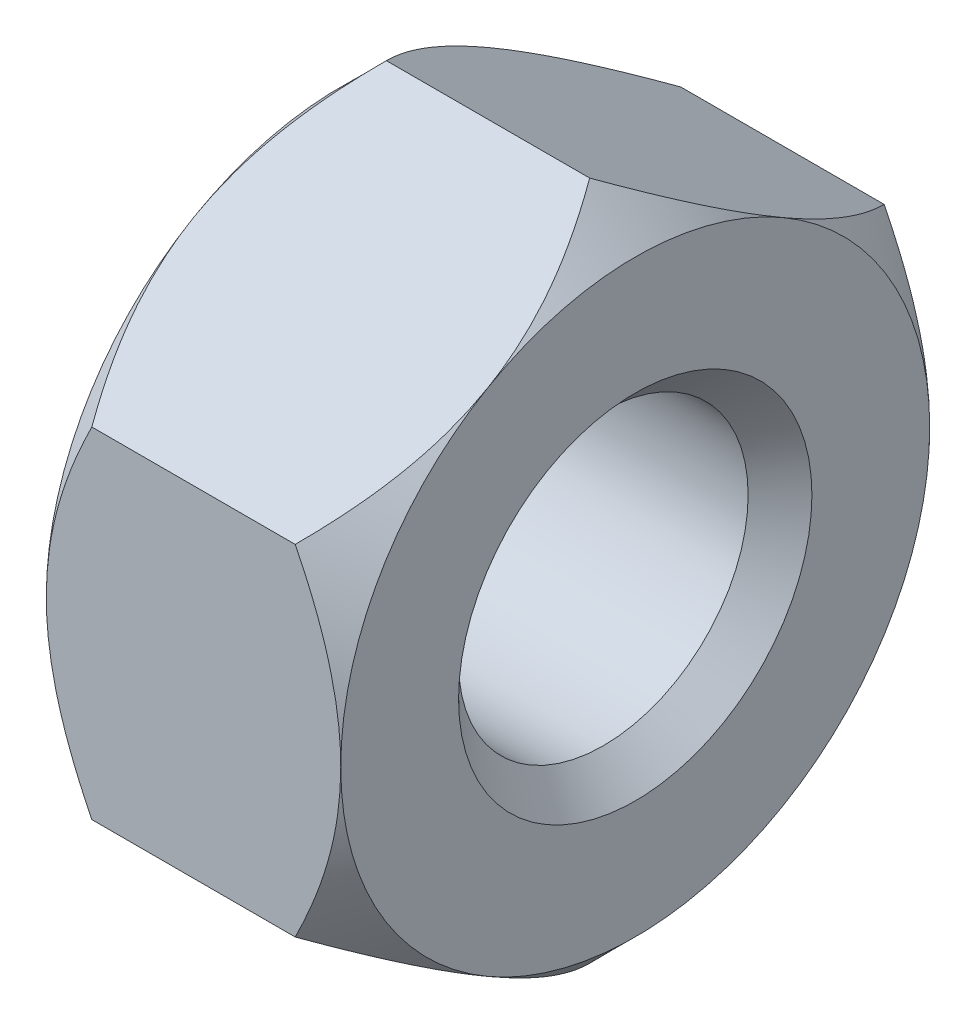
ISO-10303-21;
HEADER;
FILE_DESCRIPTION(('STEP AP214'),'2;1');
FILE_NAME('part.step','',(''),(''),'','','');
FILE_SCHEMA(('AUTOMOTIVE_DESIGN { 1 0 10303 214 1 1 1 1 }'));
ENDSEC;
DATA;
#1=APPLICATION_CONTEXT('core data for automotive mechanical design processes');
#2=APPLICATION_PROTOCOL_DEFINITION('international standard','automotive_design',2000,#1);
#3=PRODUCT_CONTEXT('',#1,'mechanical');
#4=PRODUCT('Part','Part','',(#3));
#5=PRODUCT_RELATED_PRODUCT_CATEGORY('part','',(#4));
#6=PRODUCT_DEFINITION_FORMATION('','',#4);
#7=PRODUCT_DEFINITION_CONTEXT('part definition',#1,'design');
#8=PRODUCT_DEFINITION('design','',#6,#7);
#9=PRODUCT_DEFINITION_SHAPE('','',#8);
#10=(LENGTH_UNIT() NAMED_UNIT(*) SI_UNIT(.MILLI.,.METRE.));
#11=(NAMED_UNIT(*) PLANE_ANGLE_UNIT() SI_UNIT($,.RADIAN.));
#12=(NAMED_UNIT(*) SI_UNIT($,.STERADIAN.) SOLID_ANGLE_UNIT());
#13=UNCERTAINTY_MEASURE_WITH_UNIT(LENGTH_MEASURE(1.E-05),#10,'distance_accuracy_value','');
#14=(GEOMETRIC_REPRESENTATION_CONTEXT(3) GLOBAL_UNCERTAINTY_ASSIGNED_CONTEXT((#13)) GLOBAL_UNIT_ASSIGNED_CONTEXT((#10,
#11,#12)) REPRESENTATION_CONTEXT('',''));
#15=CARTESIAN_POINT('',(0.,0.,0.));
#16=DIRECTION('',(0.,0.,1.));
#17=DIRECTION('',(1.,0.,0.));
#18=AXIS2_PLACEMENT_3D('',#15,#16,#17);
#19=CARTESIAN_POINT('',(5.,5.,0.));
#20=DIRECTION('',(-1.,0.,0.));
#21=DIRECTION('',(0.,0.,1.));
#22=AXIS2_PLACEMENT_3D('',#19,#20,#21);
#23=PLANE('',#22);
#24=CARTESIAN_POINT('',(4.99999999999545,0.,0.));
#25=DIRECTION('',(1.,0.,0.));
#26=DIRECTION('',(0.,0.,-1.));
#27=AXIS2_PLACEMENT_3D('',#24,#25,#26);
#28=CIRCLE('',#27,3.00000000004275);
#29=CARTESIAN_POINT('',(4.99999999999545,0.,-3.00000000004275));
#30=VERTEX_POINT('',#29);
#31=EDGE_CURVE('E273',#30,#30,#28,.F.);
#32=ORIENTED_EDGE('',*,*,#31,.T.);
#33=EDGE_LOOP('',(#32));
#34=FACE_BOUND('',#33,.T.);
#35=CARTESIAN_POINT('',(4.99999999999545,0.,0.));
#36=DIRECTION('',(-1.,0.,0.));
#37=DIRECTION('',(0.,0.,1.));
#38=AXIS2_PLACEMENT_3D('',#35,#36,#37);
#39=CIRCLE('',#38,4.99999999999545);
#40=CARTESIAN_POINT('',(4.99999999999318,-4.3301270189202,2.4999999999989));
#41=VERTEX_POINT('',#40);
#42=CARTESIAN_POINT('',(4.99999999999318,0.,4.99999999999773));
#43=VERTEX_POINT('',#42);
#44=EDGE_CURVE('E117',#41,#43,#39,.T.);
#45=ORIENTED_EDGE('',*,*,#44,.F.);
#46=CARTESIAN_POINT('',(4.99999999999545,0.,0.));
#47=DIRECTION('',(-1.,0.,0.));
#48=DIRECTION('',(0.,0.,1.));
#49=AXIS2_PLACEMENT_3D('',#46,#47,#48);
#50=CIRCLE('',#49,4.99999999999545);
#51=CARTESIAN_POINT('',(4.99999999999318,-4.33012701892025,-2.49999999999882));
#52=VERTEX_POINT('',#51);
#53=EDGE_CURVE('E20',#52,#41,#50,.T.);
#54=ORIENTED_EDGE('',*,*,#53,.F.);
#55=CARTESIAN_POINT('',(4.99999999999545,0.,0.));
#56=DIRECTION('',(-1.,0.,0.));
#57=DIRECTION('',(0.,0.,1.));
#58=AXIS2_PLACEMENT_3D('',#55,#56,#57);
#59=CIRCLE('',#58,4.99999999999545);
#60=CARTESIAN_POINT('',(4.99999999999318,0.,-4.99999999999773));
#61=VERTEX_POINT('',#60);
#62=EDGE_CURVE('E103',#61,#52,#59,.T.);
#63=ORIENTED_EDGE('',*,*,#62,.F.);
#64=CARTESIAN_POINT('',(4.99999999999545,0.,0.));
#65=DIRECTION('',(-1.,0.,0.));
#66=DIRECTION('',(0.,0.,1.));
#67=AXIS2_PLACEMENT_3D('',#64,#65,#66);
#68=CIRCLE('',#67,4.99999999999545);
#69=CARTESIAN_POINT('',(4.99999999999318,4.3301270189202,-2.4999999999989));
#70=VERTEX_POINT('',#69);
#71=EDGE_CURVE('E113',#70,#61,#68,.T.);
#72=ORIENTED_EDGE('',*,*,#71,.F.);
#73=CARTESIAN_POINT('',(4.99999999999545,0.,0.));
#74=DIRECTION('',(-1.,0.,0.));
#75=DIRECTION('',(0.,0.,1.));
#76=AXIS2_PLACEMENT_3D('',#73,#74,#75);
#77=CIRCLE('',#76,4.99999999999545);
#78=CARTESIAN_POINT('',(4.99999999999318,4.33012701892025,2.49999999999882));
#79=VERTEX_POINT('',#78);
#80=EDGE_CURVE('E414',#79,#70,#77,.T.);
#81=ORIENTED_EDGE('',*,*,#80,.F.);
#82=CARTESIAN_POINT('',(4.99999999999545,0.,0.));
#83=DIRECTION('',(-1.,0.,0.));
#84=DIRECTION('',(0.,0.,1.));
#85=AXIS2_PLACEMENT_3D('',#82,#83,#84);
#86=CIRCLE('',#85,4.99999999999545);
#87=EDGE_CURVE('E436',#43,#79,#86,.T.);
#88=ORIENTED_EDGE('',*,*,#87,.F.);
#89=EDGE_LOOP('',(#45,#54,#63,#72,#81,#88));
#90=FACE_BOUND('',#89,.T.);
#91=ADVANCED_FACE('F17',(#34,#90),#23,.F.);
#92=CARTESIAN_POINT('',(4.22185629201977,0.,0.));
#93=DIRECTION('',(-1.,0.,0.));
#94=DIRECTION('',(0.,0.,1.));
#95=AXIS2_PLACEMENT_3D('',#92,#93,#94);
#96=CONICAL_SURFACE('',#95,5.7781437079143,0.785398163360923);
#97=CARTESIAN_POINT('',(4.99999999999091,-4.33012701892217,2.50000000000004));
#98=CARTESIAN_POINT('',(5.00000614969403,-4.36852433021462,2.43349390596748));
#99=CARTESIAN_POINT('',(4.99822988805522,-4.40691590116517,2.36699775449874));
#100=CARTESIAN_POINT('',(4.99117047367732,-4.48361249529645,2.23415535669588));
#101=CARTESIAN_POINT('',(4.98588787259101,-4.52191753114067,2.16780908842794));
#102=CARTESIAN_POINT('',(4.96489427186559,-4.63645730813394,1.96942037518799));
#103=CARTESIAN_POINT('',(4.94403701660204,-4.7124689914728,1.83776427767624));
#104=CARTESIAN_POINT('',(4.89011214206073,-4.86218746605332,1.57844427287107));
#105=CARTESIAN_POINT('',(4.85723342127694,-4.93591172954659,1.45075010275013));
#106=CARTESIAN_POINT('',(4.78069544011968,-5.0819613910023,1.19778466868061));
#107=CARTESIAN_POINT('',(4.73703280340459,-5.15428634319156,1.07251417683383));
#108=CARTESIAN_POINT('',(4.65724434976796,-5.27256953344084,0.867641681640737));
#109=CARTESIAN_POINT('',(4.62374942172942,-5.31898017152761,0.787256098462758));
#110=CARTESIAN_POINT('',(4.55326206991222,-5.41112170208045,0.62766228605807));
#111=CARTESIAN_POINT('',(4.5162703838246,-5.45685273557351,0.548453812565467));
#112=CARTESIAN_POINT('',(4.43878280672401,-5.54812148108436,0.390371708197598));
#113=CARTESIAN_POINT('',(4.39825463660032,-5.59365230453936,0.311510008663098));
#114=CARTESIAN_POINT('',(4.31439142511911,-5.68406037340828,0.154918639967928));
#115=CARTESIAN_POINT('',(4.27105657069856,-5.72893766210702,0.0771888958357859));
#116=CARTESIAN_POINT('',(4.22649730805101,-5.77350269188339,2.22876933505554E-11));
#117=B_SPLINE_CURVE_WITH_KNOTS('',3,(#97,#98,#99,#100,#101,#102,#103,#104,#105,#106,#107,#108,
#109,#110,#111,#112,#113,#114,#115,#116),.UNSPECIFIED.,.F.,.F.,(4,2,2,2,2,2,2,2,2,4),(0.,
0.230341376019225,0.460646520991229,0.920346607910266,1.37311358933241,1.82602250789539,
2.12199524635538,2.41790568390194,2.71687590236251,3.0158262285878),.UNSPECIFIED.);
#118=CARTESIAN_POINT('',(4.22649730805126,-5.77350269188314,0.));
#119=VERTEX_POINT('',#118);
#120=EDGE_CURVE('E131',#41,#119,#117,.T.);
#121=ORIENTED_EDGE('',*,*,#120,.T.);
#122=CARTESIAN_POINT('',(4.22649730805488,-5.77350269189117,-2.52782082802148E-11));
#123=CARTESIAN_POINT('',(4.27644123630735,-5.72355106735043,-0.0865187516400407));
#124=CARTESIAN_POINT('',(4.32484266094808,-5.6732131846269,-0.173706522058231));
#125=CARTESIAN_POINT('',(4.41808914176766,-5.5716870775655,-0.349554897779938));
#126=CARTESIAN_POINT('',(4.46293213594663,-5.52049838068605,-0.438216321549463));
#127=CARTESIAN_POINT('',(4.59183821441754,-5.36501502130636,-0.707521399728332));
#128=CARTESIAN_POINT('',(4.66967475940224,-5.25939347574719,-0.890463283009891));
#129=CARTESIAN_POINT('',(4.8018131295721,-5.04779804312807,-1.25695732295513));
#130=CARTESIAN_POINT('',(4.85673320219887,-4.9419236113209,-1.44033721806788));
#131=CARTESIAN_POINT('',(4.92027051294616,-4.7814199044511,-1.71833779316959));
#132=CARTESIAN_POINT('',(4.93829854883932,-4.72770350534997,-1.81137732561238));
#133=CARTESIAN_POINT('',(4.96767507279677,-4.61982204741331,-1.99823349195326));
#134=CARTESIAN_POINT('',(4.97902569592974,-4.56565713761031,-2.09204986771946));
#135=CARTESIAN_POINT('',(4.9912304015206,-4.48127537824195,-2.23820336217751));
#136=CARTESIAN_POINT('',(4.99450796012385,-4.45114159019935,-2.2903966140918));
#137=CARTESIAN_POINT('',(4.99889831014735,-4.39071515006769,-2.39505827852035));
#138=CARTESIAN_POINT('',(5.00000247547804,-4.3604223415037,-2.44752696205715));
#139=CARTESIAN_POINT('',(4.99999999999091,-4.33012701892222,-2.49999999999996));
#140=B_SPLINE_CURVE_WITH_KNOTS('',3,(#122,#123,#124,#125,#126,#127,#128,#129,#130,#131,#132,
#133,#134,#135,#136,#137,#138,#139),.UNSPECIFIED.,.F.,.F.,(4,2,2,2,2,2,2,2,4),(0.,
0.335055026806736,0.670302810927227,1.34476662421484,1.99962838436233,2.32625984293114,
2.6527868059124,2.83382184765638,3.0155739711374),.UNSPECIFIED.);
#141=EDGE_CURVE('E125',#119,#52,#140,.T.);
#142=ORIENTED_EDGE('',*,*,#141,.T.);
#143=ORIENTED_EDGE('',*,*,#53,.T.);
#144=EDGE_LOOP('',(#121,#142,#143));
#145=FACE_BOUND('',#144,.T.);
#146=ADVANCED_FACE('F130',(#145),#96,.T.);
#147=CARTESIAN_POINT('',(4.22185629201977,0.,0.));
#148=DIRECTION('',(-1.,0.,0.));
#149=DIRECTION('',(0.,0.,1.));
#150=AXIS2_PLACEMENT_3D('',#147,#148,#149);
#151=CONICAL_SURFACE('',#150,5.7781437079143,0.785398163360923);
#152=CARTESIAN_POINT('',(4.99999999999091,-4.33012701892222,-2.49999999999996));
#153=CARTESIAN_POINT('',(5.00000614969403,-4.29172970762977,-2.56650609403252));
#154=CARTESIAN_POINT('',(4.99822988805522,-4.25333813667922,-2.63300224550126));
#155=CARTESIAN_POINT('',(4.99117047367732,-4.17664154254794,-2.76584464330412));
#156=CARTESIAN_POINT('',(4.98588787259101,-4.13833650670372,-2.83219091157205));
#157=CARTESIAN_POINT('',(4.96489427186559,-4.02379672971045,-3.03057962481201));
#158=CARTESIAN_POINT('',(4.94403701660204,-3.94778504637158,-3.16223572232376));
#159=CARTESIAN_POINT('',(4.89011214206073,-3.79806657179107,-3.42155572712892));
#160=CARTESIAN_POINT('',(4.85723342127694,-3.7243423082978,-3.54924989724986));
#161=CARTESIAN_POINT('',(4.78069544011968,-3.57829264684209,-3.80221533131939));
#162=CARTESIAN_POINT('',(4.73703280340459,-3.50596769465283,-3.92748582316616));
#163=CARTESIAN_POINT('',(4.65724434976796,-3.38768450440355,-4.13235831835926));
#164=CARTESIAN_POINT('',(4.62374942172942,-3.34127386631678,-4.21274390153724));
#165=CARTESIAN_POINT('',(4.55326206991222,-3.24913233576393,-4.37233771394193));
#166=CARTESIAN_POINT('',(4.5162703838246,-3.20340130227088,-4.45154618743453));
#167=CARTESIAN_POINT('',(4.43878280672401,-3.11213255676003,-4.6096282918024));
#168=CARTESIAN_POINT('',(4.39825463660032,-3.06660173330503,-4.6884899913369));
#169=CARTESIAN_POINT('',(4.31439142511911,-2.9761936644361,-4.84508136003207));
#170=CARTESIAN_POINT('',(4.27105657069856,-2.93131637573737,-4.92281110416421));
#171=CARTESIAN_POINT('',(4.22649730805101,-2.886751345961,-4.99999999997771));
#172=B_SPLINE_CURVE_WITH_KNOTS('',3,(#152,#153,#154,#155,#156,#157,#158,#159,#160,#161,#162,
#163,#164,#165,#166,#167,#168,#169,#170,#171),.UNSPECIFIED.,.F.,.F.,(4,2,2,2,2,2,2,2,2,4),(0.,
0.230341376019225,0.460646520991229,0.920346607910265,1.3731135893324,1.82602250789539,
2.12199524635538,2.41790568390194,2.71687590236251,3.01582622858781),.UNSPECIFIED.);
#173=CARTESIAN_POINT('',(4.22649730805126,-2.88675134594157,-4.99999999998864));
#174=VERTEX_POINT('',#173);
#175=EDGE_CURVE('E107',#52,#174,#172,.T.);
#176=ORIENTED_EDGE('',*,*,#175,.T.);
#177=CARTESIAN_POINT('',(4.22649730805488,-2.88675134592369,-5.00000000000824));
#178=CARTESIAN_POINT('',(4.27644123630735,-2.78684809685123,-5.00000000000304));
#179=CARTESIAN_POINT('',(4.32484266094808,-2.68617233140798,-5.00000000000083));
#180=CARTESIAN_POINT('',(4.41808914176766,-2.48312011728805,-4.99999999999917));
#181=CARTESIAN_POINT('',(4.46293213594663,-2.38074272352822,-4.99999999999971));
#182=CARTESIAN_POINT('',(4.59183821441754,-2.06977600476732,-5.00000000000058));
#183=CARTESIAN_POINT('',(4.66967475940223,-1.85853291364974,-5.00000000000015));
#184=CARTESIAN_POINT('',(4.8018131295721,-1.43534204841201,-4.99999999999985));
#185=CARTESIAN_POINT('',(4.85673320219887,-1.22359318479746,-4.99999999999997));
#186=CARTESIAN_POINT('',(4.92027051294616,-0.9025857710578,-5.00000000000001));
#187=CARTESIAN_POINT('',(4.93829854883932,-0.795152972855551,-5.));
#188=CARTESIAN_POINT('',(4.96767507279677,-0.579390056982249,-5.));
#189=CARTESIAN_POINT('',(4.97902569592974,-0.471060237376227,-5.));
#190=CARTESIAN_POINT('',(4.9912304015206,-0.302296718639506,-5.));
#191=CARTESIAN_POINT('',(4.99450796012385,-0.242029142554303,-5.));
#192=CARTESIAN_POINT('',(4.99889831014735,-0.121176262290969,-5.));
#193=CARTESIAN_POINT('',(5.00000247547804,-0.0605906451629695,-5.));
#194=CARTESIAN_POINT('',(4.99999999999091,0.,-5.));
#195=B_SPLINE_CURVE_WITH_KNOTS('',3,(#177,#178,#179,#180,#181,#182,#183,#184,#185,#186,#187,
#188,#189,#190,#191,#192,#193,#194),.UNSPECIFIED.,.F.,.F.,(4,2,2,2,2,2,2,2,4),(0.,
0.335055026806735,0.670302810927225,1.34476662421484,1.99962838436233,2.32625984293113,
2.6527868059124,2.8338218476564,3.01557397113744),.UNSPECIFIED.);
#196=EDGE_CURVE('E109',#174,#61,#195,.T.);
#197=ORIENTED_EDGE('',*,*,#196,.T.);
#198=ORIENTED_EDGE('',*,*,#62,.T.);
#199=EDGE_LOOP('',(#176,#197,#198));
#200=FACE_BOUND('',#199,.T.);
#201=ADVANCED_FACE('F105',(#200),#151,.T.);
#202=CARTESIAN_POINT('',(4.22185629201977,0.,0.));
#203=DIRECTION('',(-1.,0.,0.));
#204=DIRECTION('',(0.,0.,1.));
#205=AXIS2_PLACEMENT_3D('',#202,#203,#204);
#206=CONICAL_SURFACE('',#205,5.7781437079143,0.785398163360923);
#207=CARTESIAN_POINT('',(4.99999999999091,0.,-5.));
#208=CARTESIAN_POINT('',(5.00000614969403,0.0767946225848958,-5.));
#209=CARTESIAN_POINT('',(4.99822988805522,0.153577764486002,-5.));
#210=CARTESIAN_POINT('',(4.99117047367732,0.306970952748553,-5.));
#211=CARTESIAN_POINT('',(4.98588787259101,0.383581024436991,-5.));
#212=CARTESIAN_POINT('',(4.96489427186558,0.612660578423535,-5.));
#213=CARTESIAN_POINT('',(4.94403701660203,0.764683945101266,-5.));
#214=CARTESIAN_POINT('',(4.89011214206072,1.0641208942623,-5.));
#215=CARTESIAN_POINT('',(4.85723342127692,1.21156942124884,-5.));
#216=CARTESIAN_POINT('',(4.78069544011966,1.50366874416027,-5.));
#217=CARTESIAN_POINT('',(4.73703280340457,1.64831864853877,-5.));
#218=CARTESIAN_POINT('',(4.65724434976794,1.88488502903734,-5.));
#219=CARTESIAN_POINT('',(4.6237494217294,1.97770630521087,-5.));
#220=CARTESIAN_POINT('',(4.55326206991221,2.16198936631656,-5.));
#221=CARTESIAN_POINT('',(4.51627038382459,2.25345143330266,-5.));
#222=CARTESIAN_POINT('',(4.438782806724,2.43598892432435,-5.));
#223=CARTESIAN_POINT('',(4.39825463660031,2.52705057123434,-5.));
#224=CARTESIAN_POINT('',(4.31439142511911,2.70786670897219,-5.));
#225=CARTESIAN_POINT('',(4.27105657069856,2.79762128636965,-5.));
#226=CARTESIAN_POINT('',(4.22649730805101,2.88675134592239,-5.));
#227=B_SPLINE_CURVE_WITH_KNOTS('',3,(#207,#208,#209,#210,#211,#212,#213,#214,#215,#216,#217,
#218,#219,#220,#221,#222,#223,#224,#225,#226),.UNSPECIFIED.,.F.,.F.,(4,2,2,2,2,2,2,2,2,4),(0.,
0.230341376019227,0.460646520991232,0.920346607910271,1.37311358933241,1.8260225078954,
2.12199524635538,2.41790568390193,2.71687590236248,3.01582622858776),.UNSPECIFIED.);
#228=CARTESIAN_POINT('',(4.22649730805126,2.88675134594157,-4.99999999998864));
#229=VERTEX_POINT('',#228);
#230=EDGE_CURVE('E166',#61,#229,#227,.T.);
#231=ORIENTED_EDGE('',*,*,#230,.T.);
#232=CARTESIAN_POINT('',(4.22649730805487,2.88675134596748,-4.99999999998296));
#233=CARTESIAN_POINT('',(4.27644123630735,2.93670297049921,-4.913481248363));
#234=CARTESIAN_POINT('',(4.32484266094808,2.98704085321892,-4.8262934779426));
#235=CARTESIAN_POINT('',(4.41808914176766,3.08856696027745,-4.65044510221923));
#236=CARTESIAN_POINT('',(4.46293213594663,3.13975565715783,-4.56178367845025));
#237=CARTESIAN_POINT('',(4.59183821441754,3.29523901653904,-4.29247860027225));
#238=CARTESIAN_POINT('',(4.66967475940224,3.40086056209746,-4.10953671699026));
#239=CARTESIAN_POINT('',(4.8018131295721,3.61245599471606,-3.74304267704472));
#240=CARTESIAN_POINT('',(4.85673320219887,3.71833042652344,-3.55966278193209));
#241=CARTESIAN_POINT('',(4.92027051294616,3.87883413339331,-3.28166220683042));
#242=CARTESIAN_POINT('',(4.93829854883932,3.93255053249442,-3.18862267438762));
#243=CARTESIAN_POINT('',(4.96767507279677,4.04043199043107,-3.00176650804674));
#244=CARTESIAN_POINT('',(4.97902569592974,4.09459690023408,-2.90795013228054));
#245=CARTESIAN_POINT('',(4.9912304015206,4.17897865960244,-2.76179663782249));
#246=CARTESIAN_POINT('',(4.99450796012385,4.20911244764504,-2.7096033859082));
#247=CARTESIAN_POINT('',(4.99889831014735,4.26953888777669,-2.60494172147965));
#248=CARTESIAN_POINT('',(5.00000247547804,4.29983169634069,-2.55247303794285));
#249=CARTESIAN_POINT('',(4.99999999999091,4.33012701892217,-2.50000000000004));
#250=B_SPLINE_CURVE_WITH_KNOTS('',3,(#232,#233,#234,#235,#236,#237,#238,#239,#240,#241,#242,
#243,#244,#245,#246,#247,#248,#249),.UNSPECIFIED.,.F.,.F.,(4,2,2,2,2,2,2,2,4),(0.,
0.335055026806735,0.670302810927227,1.34476662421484,1.99962838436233,2.32625984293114,
2.6527868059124,2.83382184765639,3.0155739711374),.UNSPECIFIED.);
#251=EDGE_CURVE('E378',#229,#70,#250,.T.);
#252=ORIENTED_EDGE('',*,*,#251,.T.);
#253=ORIENTED_EDGE('',*,*,#71,.T.);
#254=EDGE_LOOP('',(#231,#252,#253));
#255=FACE_BOUND('',#254,.T.);
#256=ADVANCED_FACE('F158',(#255),#206,.T.);
#257=CARTESIAN_POINT('',(4.22185629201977,0.,0.));
#258=DIRECTION('',(-1.,0.,0.));
#259=DIRECTION('',(0.,0.,1.));
#260=AXIS2_PLACEMENT_3D('',#257,#258,#259);
#261=CONICAL_SURFACE('',#260,5.7781437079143,0.785398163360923);
#262=CARTESIAN_POINT('',(4.99999999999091,0.,5.));
#263=CARTESIAN_POINT('',(5.00000614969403,-0.0767946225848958,5.));
#264=CARTESIAN_POINT('',(4.99822988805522,-0.153577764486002,5.));
#265=CARTESIAN_POINT('',(4.99117047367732,-0.306970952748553,5.));
#266=CARTESIAN_POINT('',(4.98588787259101,-0.383581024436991,5.));
#267=CARTESIAN_POINT('',(4.96489427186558,-0.612660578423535,5.));
#268=CARTESIAN_POINT('',(4.94403701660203,-0.764683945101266,5.));
#269=CARTESIAN_POINT('',(4.89011214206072,-1.0641208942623,5.));
#270=CARTESIAN_POINT('',(4.85723342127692,-1.21156942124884,5.));
#271=CARTESIAN_POINT('',(4.78069544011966,-1.50366874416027,5.));
#272=CARTESIAN_POINT('',(4.73703280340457,-1.64831864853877,5.));
#273=CARTESIAN_POINT('',(4.65724434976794,-1.88488502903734,5.));
#274=CARTESIAN_POINT('',(4.6237494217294,-1.97770630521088,5.));
#275=CARTESIAN_POINT('',(4.55326206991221,-2.16198936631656,5.));
#276=CARTESIAN_POINT('',(4.51627038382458,-2.25345143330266,5.));
#277=CARTESIAN_POINT('',(4.438782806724,-2.43598892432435,5.));
#278=CARTESIAN_POINT('',(4.39825463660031,-2.52705057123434,5.));
#279=CARTESIAN_POINT('',(4.31439142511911,-2.70786670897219,5.));
#280=CARTESIAN_POINT('',(4.27105657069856,-2.79762128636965,5.));
#281=CARTESIAN_POINT('',(4.22649730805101,-2.88675134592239,5.));
#282=B_SPLINE_CURVE_WITH_KNOTS('',3,(#262,#263,#264,#265,#266,#267,#268,#269,#270,#271,#272,
#273,#274,#275,#276,#277,#278,#279,#280,#281),.UNSPECIFIED.,.F.,.F.,(4,2,2,2,2,2,2,2,2,4),(0.,
0.230341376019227,0.460646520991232,0.920346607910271,1.37311358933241,1.8260225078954,
2.12199524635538,2.41790568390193,2.71687590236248,3.01582622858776),.UNSPECIFIED.);
#283=CARTESIAN_POINT('',(4.2264973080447,-2.88675134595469,4.99999999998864));
#284=VERTEX_POINT('',#283);
#285=EDGE_CURVE('E284',#43,#284,#282,.T.);
#286=ORIENTED_EDGE('',*,*,#285,.T.);
#287=CARTESIAN_POINT('',(4.22649730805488,-2.88675134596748,4.99999999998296));
#288=CARTESIAN_POINT('',(4.27644123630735,-2.93670297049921,4.91348124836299));
#289=CARTESIAN_POINT('',(4.32484266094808,-2.98704085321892,4.8262934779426));
#290=CARTESIAN_POINT('',(4.41808914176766,-3.08856696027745,4.65044510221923));
#291=CARTESIAN_POINT('',(4.46293213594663,-3.13975565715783,4.56178367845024));
#292=CARTESIAN_POINT('',(4.59183821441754,-3.29523901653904,4.29247860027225));
#293=CARTESIAN_POINT('',(4.66967475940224,-3.40086056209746,4.10953671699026));
#294=CARTESIAN_POINT('',(4.8018131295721,-3.61245599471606,3.74304267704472));
#295=CARTESIAN_POINT('',(4.85673320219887,-3.71833042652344,3.55966278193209));
#296=CARTESIAN_POINT('',(4.92027051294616,-3.87883413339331,3.28166220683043));
#297=CARTESIAN_POINT('',(4.93829854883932,-3.93255053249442,3.18862267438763));
#298=CARTESIAN_POINT('',(4.96767507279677,-4.04043199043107,3.00176650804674));
#299=CARTESIAN_POINT('',(4.97902569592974,-4.09459690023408,2.90795013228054));
#300=CARTESIAN_POINT('',(4.9912304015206,-4.17897865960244,2.76179663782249));
#301=CARTESIAN_POINT('',(4.99450796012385,-4.20911244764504,2.7096033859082));
#302=CARTESIAN_POINT('',(4.99889831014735,-4.26953888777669,2.60494172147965));
#303=CARTESIAN_POINT('',(5.00000247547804,-4.29983169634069,2.55247303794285));
#304=CARTESIAN_POINT('',(4.99999999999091,-4.33012701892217,2.50000000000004));
#305=B_SPLINE_CURVE_WITH_KNOTS('',3,(#287,#288,#289,#290,#291,#292,#293,#294,#295,#296,#297,
#298,#299,#300,#301,#302,#303,#304),.UNSPECIFIED.,.F.,.F.,(4,2,2,2,2,2,2,2,4),(0.,
0.335055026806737,0.670302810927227,1.34476662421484,1.99962838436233,2.32625984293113,
2.6527868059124,2.83382184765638,3.0155739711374),.UNSPECIFIED.);
#306=EDGE_CURVE('E267',#284,#41,#305,.T.);
#307=ORIENTED_EDGE('',*,*,#306,.T.);
#308=ORIENTED_EDGE('',*,*,#44,.T.);
#309=EDGE_LOOP('',(#286,#307,#308));
#310=FACE_BOUND('',#309,.T.);
#311=ADVANCED_FACE('F275',(#310),#261,.T.);
#312=CARTESIAN_POINT('',(4.22185629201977,0.,0.));
#313=DIRECTION('',(-1.,0.,0.));
#314=DIRECTION('',(0.,0.,1.));
#315=AXIS2_PLACEMENT_3D('',#312,#313,#314);
#316=CONICAL_SURFACE('',#315,5.7781437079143,0.785398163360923);
#317=CARTESIAN_POINT('',(4.22649730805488,5.77350269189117,2.52780452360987E-11));
#318=CARTESIAN_POINT('',(4.27644123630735,5.72355106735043,0.0865187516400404));
#319=CARTESIAN_POINT('',(4.32484266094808,5.6732131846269,0.173706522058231));
#320=CARTESIAN_POINT('',(4.41808914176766,5.5716870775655,0.349554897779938));
#321=CARTESIAN_POINT('',(4.46293213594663,5.52049838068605,0.438216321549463));
#322=CARTESIAN_POINT('',(4.59183821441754,5.36501502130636,0.707521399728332));
#323=CARTESIAN_POINT('',(4.66967475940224,5.25939347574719,0.890463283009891));
#324=CARTESIAN_POINT('',(4.8018131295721,5.04779804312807,1.25695732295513));
#325=CARTESIAN_POINT('',(4.85673320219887,4.9419236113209,1.44033721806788));
#326=CARTESIAN_POINT('',(4.92027051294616,4.7814199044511,1.71833779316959));
#327=CARTESIAN_POINT('',(4.93829854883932,4.72770350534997,1.81137732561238));
#328=CARTESIAN_POINT('',(4.96767507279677,4.61982204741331,1.99823349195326));
#329=CARTESIAN_POINT('',(4.97902569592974,4.56565713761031,2.09204986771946));
#330=CARTESIAN_POINT('',(4.9912304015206,4.48127537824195,2.23820336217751));
#331=CARTESIAN_POINT('',(4.99450796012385,4.45114159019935,2.2903966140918));
#332=CARTESIAN_POINT('',(4.99889831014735,4.39071515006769,2.39505827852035));
#333=CARTESIAN_POINT('',(5.00000247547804,4.3604223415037,2.44752696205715));
#334=CARTESIAN_POINT('',(4.99999999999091,4.33012701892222,2.49999999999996));
#335=B_SPLINE_CURVE_WITH_KNOTS('',3,(#317,#318,#319,#320,#321,#322,#323,#324,#325,#326,#327,
#328,#329,#330,#331,#332,#333,#334),.UNSPECIFIED.,.F.,.F.,(4,2,2,2,2,2,2,2,4),(0.,
0.335055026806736,0.670302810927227,1.34476662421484,1.99962838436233,2.32625984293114,
2.6527868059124,2.83382184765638,3.0155739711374),.UNSPECIFIED.);
#336=CARTESIAN_POINT('',(4.22649730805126,5.77350269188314,0.));
#337=VERTEX_POINT('',#336);
#338=EDGE_CURVE('E293',#337,#79,#335,.T.);
#339=ORIENTED_EDGE('',*,*,#338,.T.);
#340=ORIENTED_EDGE('',*,*,#80,.T.);
#341=CARTESIAN_POINT('',(4.99999999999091,4.33012701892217,-2.50000000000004));
#342=CARTESIAN_POINT('',(5.00000614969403,4.36852433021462,-2.43349390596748));
#343=CARTESIAN_POINT('',(4.99822988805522,4.40691590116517,-2.36699775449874));
#344=CARTESIAN_POINT('',(4.99117047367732,4.48361249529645,-2.23415535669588));
#345=CARTESIAN_POINT('',(4.98588787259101,4.52191753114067,-2.16780908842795));
#346=CARTESIAN_POINT('',(4.96489427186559,4.63645730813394,-1.96942037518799));
#347=CARTESIAN_POINT('',(4.94403701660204,4.7124689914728,-1.83776427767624));
#348=CARTESIAN_POINT('',(4.89011214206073,4.86218746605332,-1.57844427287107));
#349=CARTESIAN_POINT('',(4.85723342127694,4.93591172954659,-1.45075010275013));
#350=CARTESIAN_POINT('',(4.78069544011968,5.0819613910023,-1.19778466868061));
#351=CARTESIAN_POINT('',(4.73703280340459,5.15428634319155,-1.07251417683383));
#352=CARTESIAN_POINT('',(4.65724434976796,5.27256953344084,-0.867641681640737));
#353=CARTESIAN_POINT('',(4.62374942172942,5.31898017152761,-0.787256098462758));
#354=CARTESIAN_POINT('',(4.55326206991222,5.41112170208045,-0.62766228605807));
#355=CARTESIAN_POINT('',(4.5162703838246,5.45685273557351,-0.548453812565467));
#356=CARTESIAN_POINT('',(4.43878280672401,5.54812148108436,-0.390371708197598));
#357=CARTESIAN_POINT('',(4.39825463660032,5.59365230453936,-0.311510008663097));
#358=CARTESIAN_POINT('',(4.31439142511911,5.68406037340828,-0.154918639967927));
#359=CARTESIAN_POINT('',(4.27105657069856,5.72893766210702,-0.0771888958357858));
#360=CARTESIAN_POINT('',(4.22649730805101,5.77350269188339,-2.22884048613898E-11));
#361=B_SPLINE_CURVE_WITH_KNOTS('',3,(#341,#342,#343,#344,#345,#346,#347,#348,#349,#350,#351,
#352,#353,#354,#355,#356,#357,#358,#359,#360),.UNSPECIFIED.,.F.,.F.,(4,2,2,2,2,2,2,2,2,4),(0.,
0.230341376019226,0.460646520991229,0.920346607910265,1.37311358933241,1.82602250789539,
2.12199524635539,2.41790568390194,2.71687590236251,3.01582622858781),.UNSPECIFIED.);
#362=EDGE_CURVE('E416',#70,#337,#361,.T.);
#363=ORIENTED_EDGE('',*,*,#362,.T.);
#364=EDGE_LOOP('',(#339,#340,#363));
#365=FACE_BOUND('',#364,.T.);
#366=ADVANCED_FACE('F279',(#365),#316,.T.);
#367=CARTESIAN_POINT('',(4.22185629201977,0.,0.));
#368=DIRECTION('',(-1.,0.,0.));
#369=DIRECTION('',(0.,0.,1.));
#370=AXIS2_PLACEMENT_3D('',#367,#368,#369);
#371=CONICAL_SURFACE('',#370,5.7781437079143,0.785398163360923);
#372=CARTESIAN_POINT('',(4.99999999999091,4.33012701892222,2.49999999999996));
#373=CARTESIAN_POINT('',(5.00000614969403,4.29172970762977,2.56650609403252));
#374=CARTESIAN_POINT('',(4.99822988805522,4.25333813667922,2.63300224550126));
#375=CARTESIAN_POINT('',(4.99117047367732,4.17664154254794,2.76584464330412));
#376=CARTESIAN_POINT('',(4.98588787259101,4.13833650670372,2.83219091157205));
#377=CARTESIAN_POINT('',(4.96489427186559,4.02379672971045,3.03057962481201));
#378=CARTESIAN_POINT('',(4.94403701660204,3.94778504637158,3.16223572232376));
#379=CARTESIAN_POINT('',(4.89011214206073,3.79806657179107,3.42155572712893));
#380=CARTESIAN_POINT('',(4.85723342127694,3.7243423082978,3.54924989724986));
#381=CARTESIAN_POINT('',(4.78069544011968,3.57829264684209,3.80221533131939));
#382=CARTESIAN_POINT('',(4.73703280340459,3.50596769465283,3.92748582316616));
#383=CARTESIAN_POINT('',(4.65724434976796,3.38768450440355,4.13235831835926));
#384=CARTESIAN_POINT('',(4.62374942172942,3.34127386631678,4.21274390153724));
#385=CARTESIAN_POINT('',(4.55326206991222,3.24913233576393,4.37233771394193));
#386=CARTESIAN_POINT('',(4.5162703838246,3.20340130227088,4.45154618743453));
#387=CARTESIAN_POINT('',(4.43878280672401,3.11213255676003,4.6096282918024));
#388=CARTESIAN_POINT('',(4.39825463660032,3.06660173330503,4.6884899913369));
#389=CARTESIAN_POINT('',(4.31439142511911,2.9761936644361,4.84508136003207));
#390=CARTESIAN_POINT('',(4.27105657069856,2.93131637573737,4.92281110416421));
#391=CARTESIAN_POINT('',(4.22649730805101,2.886751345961,4.99999999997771));
#392=B_SPLINE_CURVE_WITH_KNOTS('',3,(#372,#373,#374,#375,#376,#377,#378,#379,#380,#381,#382,
#383,#384,#385,#386,#387,#388,#389,#390,#391),.UNSPECIFIED.,.F.,.F.,(4,2,2,2,2,2,2,2,2,4),(0.,
0.230341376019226,0.460646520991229,0.920346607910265,1.3731135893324,1.82602250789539,
2.12199524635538,2.41790568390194,2.71687590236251,3.01582622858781),.UNSPECIFIED.);
#393=CARTESIAN_POINT('',(4.2264973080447,2.88675134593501,5.));
#394=VERTEX_POINT('',#393);
#395=EDGE_CURVE('E386',#79,#394,#392,.T.);
#396=ORIENTED_EDGE('',*,*,#395,.T.);
#397=CARTESIAN_POINT('',(4.22649730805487,2.88675134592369,5.00000000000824));
#398=CARTESIAN_POINT('',(4.27644123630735,2.78684809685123,5.00000000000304));
#399=CARTESIAN_POINT('',(4.32484266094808,2.68617233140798,5.00000000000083));
#400=CARTESIAN_POINT('',(4.41808914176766,2.48312011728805,4.99999999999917));
#401=CARTESIAN_POINT('',(4.46293213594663,2.38074272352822,4.99999999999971));
#402=CARTESIAN_POINT('',(4.59183821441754,2.06977600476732,5.00000000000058));
#403=CARTESIAN_POINT('',(4.66967475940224,1.85853291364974,5.00000000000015));
#404=CARTESIAN_POINT('',(4.8018131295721,1.43534204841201,4.99999999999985));
#405=CARTESIAN_POINT('',(4.85673320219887,1.22359318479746,4.99999999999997));
#406=CARTESIAN_POINT('',(4.92027051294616,0.902585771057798,5.00000000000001));
#407=CARTESIAN_POINT('',(4.93829854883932,0.795152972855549,5.));
#408=CARTESIAN_POINT('',(4.96767507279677,0.579390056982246,5.));
#409=CARTESIAN_POINT('',(4.97902569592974,0.471060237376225,5.));
#410=CARTESIAN_POINT('',(4.9912304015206,0.302296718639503,5.));
#411=CARTESIAN_POINT('',(4.99450796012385,0.242029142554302,5.));
#412=CARTESIAN_POINT('',(4.99889831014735,0.121176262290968,5.));
#413=CARTESIAN_POINT('',(5.00000247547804,0.0605906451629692,5.));
#414=CARTESIAN_POINT('',(4.99999999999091,0.,5.));
#415=B_SPLINE_CURVE_WITH_KNOTS('',3,(#397,#398,#399,#400,#401,#402,#403,#404,#405,#406,#407,
#408,#409,#410,#411,#412,#413,#414),.UNSPECIFIED.,.F.,.F.,(4,2,2,2,2,2,2,2,4),(0.,
0.335055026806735,0.670302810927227,1.34476662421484,1.99962838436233,2.32625984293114,
2.6527868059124,2.83382184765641,3.01557397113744),.UNSPECIFIED.);
#416=EDGE_CURVE('E292',#394,#43,#415,.T.);
#417=ORIENTED_EDGE('',*,*,#416,.T.);
#418=ORIENTED_EDGE('',*,*,#87,.T.);
#419=EDGE_LOOP('',(#396,#417,#418));
#420=FACE_BOUND('',#419,.T.);
#421=ADVANCED_FACE('F400',(#420),#371,.T.);
#422=CARTESIAN_POINT('',(4.99999999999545,0.,0.));
#423=DIRECTION('',(1.,0.,0.));
#424=DIRECTION('',(0.,0.,-1.));
#425=AXIS2_PLACEMENT_3D('',#422,#423,#424);
#426=CONICAL_SURFACE('',#425,3.00000000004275,0.785398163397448);
#427=CARTESIAN_POINT('',(4.4585,0.,0.));
#428=DIRECTION('',(-1.,0.,0.));
#429=DIRECTION('',(0.,0.,1.));
#430=AXIS2_PLACEMENT_3D('',#427,#428,#429);
#431=CIRCLE('',#430,2.4585);
#432=CARTESIAN_POINT('',(4.4585,0.,2.4585));
#433=VERTEX_POINT('',#432);
#434=EDGE_CURVE('E370',#433,#433,#431,.T.);
#435=ORIENTED_EDGE('',*,*,#434,.T.);
#436=EDGE_LOOP('',(#435));
#437=FACE_BOUND('',#436,.T.);
#438=ORIENTED_EDGE('',*,*,#31,.F.);
#439=EDGE_LOOP('',(#438));
#440=FACE_BOUND('',#439,.T.);
#441=ADVANCED_FACE('F255',(#437,#440),#426,.F.);
#442=CARTESIAN_POINT('',(20.,-2.88675134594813,5.));
#443=DIRECTION('',(0.,0.866025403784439,-0.5));
#444=DIRECTION('',(0.,0.5,0.866025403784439));
#445=AXIS2_PLACEMENT_3D('',#442,#443,#444);
#446=PLANE('',#445);
#447=ORIENTED_EDGE('',*,*,#120,.F.);
#448=ORIENTED_EDGE('',*,*,#306,.F.);
#449=DIRECTION('',(-1.,0.,0.));
#450=VECTOR('',#449,1.);
#451=CARTESIAN_POINT('',(20.,-2.88675134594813,5.));
#452=LINE('',#451,#450);
#453=CARTESIAN_POINT('',(0.773502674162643,-2.88675136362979,4.99999996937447));
#454=VERTEX_POINT('',#453);
#455=EDGE_CURVE('E291',#284,#454,#452,.T.);
#456=ORIENTED_EDGE('',*,*,#455,.T.);
#457=CARTESIAN_POINT('',(4.54746469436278E-12,-4.33012701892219,2.5));
#458=CARTESIAN_POINT('',(-6.14969857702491E-06,-4.29172970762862,2.56650609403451));
#459=CARTESIAN_POINT('',(0.00177011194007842,-4.25333813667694,2.6330022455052));
#460=CARTESIAN_POINT('',(0.00882952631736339,-4.17664154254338,2.76584464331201));
#461=CARTESIAN_POINT('',(0.0141121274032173,-4.13833650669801,2.83219091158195));
#462=CARTESIAN_POINT('',(0.0351057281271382,-4.02379672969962,3.03057962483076));
#463=CARTESIAN_POINT('',(0.0559629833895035,-3.94778504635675,3.16223572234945));
#464=CARTESIAN_POINT('',(0.109887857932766,-3.79806657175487,3.42155572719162));
#465=CARTESIAN_POINT('',(0.142766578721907,-3.72434230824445,3.54924989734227));
#466=CARTESIAN_POINT('',(0.219304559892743,-3.57829264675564,3.80221533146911));
#467=CARTESIAN_POINT('',(0.262967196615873,-3.50596769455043,3.92748582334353));
#468=CARTESIAN_POINT('',(0.342755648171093,-3.38768450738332,4.13235831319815));
#469=CARTESIAN_POINT('',(0.376250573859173,-3.34127387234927,4.21274389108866));
#470=CARTESIAN_POINT('',(0.446737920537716,-3.24913234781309,4.37233769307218));
#471=CARTESIAN_POINT('',(0.483729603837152,-3.20340131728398,4.45154616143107));
#472=CARTESIAN_POINT('',(0.561217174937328,-3.11213257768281,4.60962825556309));
#473=CARTESIAN_POINT('',(0.601745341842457,-3.06660175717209,4.68848994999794));
#474=CARTESIAN_POINT('',(0.685608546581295,-2.97619369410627,4.84508130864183));
#475=CARTESIAN_POINT('',(0.728943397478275,-2.93131640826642,4.92281104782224));
#476=CARTESIAN_POINT('',(0.773502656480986,-2.88675138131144,4.99999993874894));
#477=B_SPLINE_CURVE_WITH_KNOTS('',3,(#457,#458,#459,#460,#461,#462,#463,#464,#465,#466,#467,
#468,#469,#470,#471,#472,#473,#474,#475,#476),.UNSPECIFIED.,.F.,.F.,(4,2,2,2,2,2,2,2,2,4),(0.,
0.230341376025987,0.460646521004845,0.920346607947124,1.37311358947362,1.82602250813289,
2.12199522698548,2.41790564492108,2.71687584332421,3.01582614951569),.UNSPECIFIED.);
#478=CARTESIAN_POINT('',(2.27329917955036E-12,-4.33012701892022,2.49999999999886));
#479=VERTEX_POINT('',#478);
#480=EDGE_CURVE('E261',#479,#454,#477,.T.);
#481=ORIENTED_EDGE('',*,*,#480,.F.);
#482=CARTESIAN_POINT('',(0.773502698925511,-5.77350269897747,-1.22650169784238E-08));
#483=CARTESIAN_POINT('',(0.723558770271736,-5.72355107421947,0.0865187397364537));
#484=CARTESIAN_POINT('',(0.675157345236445,-5.67321319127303,0.173706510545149));
#485=CARTESIAN_POINT('',(0.581910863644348,-5.57168708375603,0.34955488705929));
#486=CARTESIAN_POINT('',(0.53706786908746,-5.5204983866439,0.438216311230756));
#487=CARTESIAN_POINT('',(0.40816178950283,-5.365015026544,0.707521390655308));
#488=CARTESIAN_POINT('',(0.330325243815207,-5.25939348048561,0.890463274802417));
#489=CARTESIAN_POINT('',(0.198186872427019,-5.04779804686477,1.25695731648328));
#490=CARTESIAN_POINT('',(0.143266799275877,-4.94192361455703,1.4403372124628));
#491=CARTESIAN_POINT('',(0.0797294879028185,-4.78141990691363,1.71833778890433));
#492=CARTESIAN_POINT('',(0.0617014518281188,-4.72770350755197,1.81137732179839));
#493=CARTESIAN_POINT('',(0.0323249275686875,-4.61982204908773,1.99823348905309));
#494=CARTESIAN_POINT('',(0.020974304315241,-4.56565713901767,2.09204986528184));
#495=CARTESIAN_POINT('',(0.00876959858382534,-4.48127537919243,2.23820336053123));
#496=CARTESIAN_POINT('',(0.00549203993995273,-4.45114159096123,2.29039661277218));
#497=CARTESIAN_POINT('',(0.0011016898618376,-4.39071515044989,2.39505827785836));
#498=CARTESIAN_POINT('',(-2.47548265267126E-06,-4.36042234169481,2.44752696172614));
#499=CARTESIAN_POINT('',(4.54746572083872E-12,-4.33012701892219,2.5));
#500=B_SPLINE_CURVE_WITH_KNOTS('',3,(#482,#483,#484,#485,#486,#487,#488,#489,#490,#491,#492,
#493,#494,#495,#496,#497,#498,#499),.UNSPECIFIED.,.F.,.F.,(4,2,2,2,2,2,2,2,4),(0.,
0.335055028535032,0.6703028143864,1.34476663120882,1.99962839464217,2.32625985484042,
2.65278681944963,2.83382186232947,3.01557398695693),.UNSPECIFIED.);
#501=CARTESIAN_POINT('',(0.77350267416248,-5.77350267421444,-3.06258111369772E-08));
#502=VERTEX_POINT('',#501);
#503=EDGE_CURVE('E234',#502,#479,#500,.T.);
#504=ORIENTED_EDGE('',*,*,#503,.F.);
#505=DIRECTION('',(1.,0.,0.));
#506=VECTOR('',#505,1.);
#507=CARTESIAN_POINT('',(20.,-5.77350269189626,0.));
#508=LINE('',#507,#506);
#509=EDGE_CURVE('E132',#502,#119,#508,.T.);
#510=ORIENTED_EDGE('',*,*,#509,.T.);
#511=EDGE_LOOP('',(#447,#448,#456,#481,#504,#510));
#512=FACE_BOUND('',#511,.T.);
#513=ADVANCED_FACE('F251',(#512),#446,.F.);
#514=CARTESIAN_POINT('',(20.,-5.77350269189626,0.));
#515=DIRECTION('',(0.,0.866025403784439,0.5));
#516=DIRECTION('',(0.,-0.5,0.866025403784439));
#517=AXIS2_PLACEMENT_3D('',#514,#515,#516);
#518=PLANE('',#517);
#519=ORIENTED_EDGE('',*,*,#175,.F.);
#520=ORIENTED_EDGE('',*,*,#141,.F.);
#521=ORIENTED_EDGE('',*,*,#509,.F.);
#522=CARTESIAN_POINT('',(4.54758081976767E-12,-4.33012701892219,-2.5));
#523=CARTESIAN_POINT('',(-6.14969857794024E-06,-4.36852433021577,-2.43349390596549));
#524=CARTESIAN_POINT('',(0.00177011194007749,-4.40691590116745,-2.36699775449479));
#525=CARTESIAN_POINT('',(0.00882952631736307,-4.48361249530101,-2.23415535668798));
#526=CARTESIAN_POINT('',(0.0141121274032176,-4.52191753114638,-2.16780908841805));
#527=CARTESIAN_POINT('',(0.0351057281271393,-4.63645730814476,-1.96942037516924));
#528=CARTESIAN_POINT('',(0.0559629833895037,-4.71246899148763,-1.83776427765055));
#529=CARTESIAN_POINT('',(0.109887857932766,-4.86218746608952,-1.57844427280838));
#530=CARTESIAN_POINT('',(0.142766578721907,-4.93591172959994,-1.45075010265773));
#531=CARTESIAN_POINT('',(0.219304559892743,-5.08196139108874,-1.19778466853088));
#532=CARTESIAN_POINT('',(0.262967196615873,-5.15428634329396,-1.07251417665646));
#533=CARTESIAN_POINT('',(0.342755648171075,-5.27256953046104,-0.867641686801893));
#534=CARTESIAN_POINT('',(0.376250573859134,-5.31898016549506,-0.787256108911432));
#535=CARTESIAN_POINT('',(0.446737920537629,-5.41112169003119,-0.627662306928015));
#536=CARTESIAN_POINT('',(0.483729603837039,-5.45685272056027,-0.548453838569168));
#537=CARTESIAN_POINT('',(0.561217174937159,-5.54812146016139,-0.390371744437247));
#538=CARTESIAN_POINT('',(0.601745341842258,-5.59365228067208,-0.31151005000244));
#539=CARTESIAN_POINT('',(0.685608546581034,-5.68406034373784,-0.154918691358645));
#540=CARTESIAN_POINT('',(0.728943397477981,-5.72893762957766,-0.0771889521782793));
#541=CARTESIAN_POINT('',(0.77350265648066,-5.77350265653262,-6.12516227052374E-08));
#542=B_SPLINE_CURVE_WITH_KNOTS('',3,(#522,#523,#524,#525,#526,#527,#528,#529,#530,#531,#532,
#533,#534,#535,#536,#537,#538,#539,#540,#541),.UNSPECIFIED.,.F.,.F.,(4,2,2,2,2,2,2,2,2,4),(0.,
0.230341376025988,0.460646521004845,0.920346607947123,1.37311358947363,1.82602250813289,
2.1219952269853,2.41790564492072,2.71687584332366,3.01582614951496),.UNSPECIFIED.);
#543=CARTESIAN_POINT('',(2.2737688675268E-12,-4.33012701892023,-2.49999999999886));
#544=VERTEX_POINT('',#543);
#545=EDGE_CURVE('E236',#544,#502,#542,.T.);
#546=ORIENTED_EDGE('',*,*,#545,.F.);
#547=CARTESIAN_POINT('',(0.77350269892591,-2.88675133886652,-5.00000001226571));
#548=CARTESIAN_POINT('',(0.723558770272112,-2.93670296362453,-4.91348126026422));
#549=CARTESIAN_POINT('',(0.675157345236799,-2.98704084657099,-4.8262934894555));
#550=CARTESIAN_POINT('',(0.581910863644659,-3.08856695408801,-4.65044511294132));
#551=CARTESIAN_POINT('',(0.53706786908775,-3.13975565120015,-4.56178368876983));
#552=CARTESIAN_POINT('',(0.408161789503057,-3.29523901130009,-4.29247860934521));
#553=CARTESIAN_POINT('',(0.330325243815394,-3.40086055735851,-4.10953672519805));
#554=CARTESIAN_POINT('',(0.198186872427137,-3.61245599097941,-3.74304268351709));
#555=CARTESIAN_POINT('',(0.143266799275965,-3.71833042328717,-3.55966278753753));
#556=CARTESIAN_POINT('',(0.0797294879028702,-3.87883413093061,-3.28166221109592));
#557=CARTESIAN_POINT('',(0.0617014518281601,-3.93255053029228,-3.18862267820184));
#558=CARTESIAN_POINT('',(0.0323249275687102,-4.04043198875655,-3.00176651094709));
#559=CARTESIAN_POINT('',(0.0209743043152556,-4.09459689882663,-2.90795013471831));
#560=CARTESIAN_POINT('',(0.00876959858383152,-4.1789786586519,-2.76179663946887));
#561=CARTESIAN_POINT('',(0.00549203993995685,-4.20911244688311,-2.7096033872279));
#562=CARTESIAN_POINT('',(0.00110168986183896,-4.26953888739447,-2.60494172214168));
#563=CARTESIAN_POINT('',(-2.47548265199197E-06,-4.29983169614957,-2.55247303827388));
#564=CARTESIAN_POINT('',(4.5475377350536E-12,-4.33012701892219,-2.5));
#565=B_SPLINE_CURVE_WITH_KNOTS('',3,(#547,#548,#549,#550,#551,#552,#553,#554,#555,#556,#557,
#558,#559,#560,#561,#562,#563,#564),.UNSPECIFIED.,.F.,.F.,(4,2,2,2,2,2,2,2,4),(0.,
0.335055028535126,0.670302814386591,1.3447666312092,1.99962839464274,2.32625985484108,
2.65278681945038,2.83382186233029,3.01557398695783),.UNSPECIFIED.);
#566=CARTESIAN_POINT('',(0.773502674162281,-2.88675131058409,-5.));
#567=VERTEX_POINT('',#566);
#568=EDGE_CURVE('E226',#567,#544,#565,.T.);
#569=ORIENTED_EDGE('',*,*,#568,.F.);
#570=DIRECTION('',(1.,0.,0.));
#571=VECTOR('',#570,1.);
#572=CARTESIAN_POINT('',(20.,-2.88675134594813,-5.));
#573=LINE('',#572,#571);
#574=EDGE_CURVE('E128',#567,#174,#573,.T.);
#575=ORIENTED_EDGE('',*,*,#574,.T.);
#576=EDGE_LOOP('',(#519,#520,#521,#546,#569,#575));
#577=FACE_BOUND('',#576,.T.);
#578=ADVANCED_FACE('F124',(#577),#518,.F.);
#579=CARTESIAN_POINT('',(20.,-2.88675134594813,-5.));
#580=DIRECTION('',(0.,0.,1.));
#581=DIRECTION('',(1.,0.,0.));
#582=AXIS2_PLACEMENT_3D('',#579,#580,#581);
#583=PLANE('',#582);
#584=ORIENTED_EDGE('',*,*,#230,.F.);
#585=ORIENTED_EDGE('',*,*,#196,.F.);
#586=ORIENTED_EDGE('',*,*,#574,.F.);
#587=CARTESIAN_POINT('',(4.54753591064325E-12,0.,-5.));
#588=CARTESIAN_POINT('',(-6.14969857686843E-06,-0.076794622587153,-5.));
#589=CARTESIAN_POINT('',(0.00177011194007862,-0.153577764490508,-5.));
#590=CARTESIAN_POINT('',(0.00882952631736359,-0.306970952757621,-5.));
#591=CARTESIAN_POINT('',(0.0141121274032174,-0.383581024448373,-5.));
#592=CARTESIAN_POINT('',(0.0351057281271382,-0.612660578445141,-5.));
#593=CARTESIAN_POINT('',(0.0559629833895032,-0.764683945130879,-5.));
#594=CARTESIAN_POINT('',(0.109887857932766,-1.06412089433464,-5.));
#595=CARTESIAN_POINT('',(0.142766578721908,-1.21156942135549,-5.));
#596=CARTESIAN_POINT('',(0.219304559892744,-1.5036687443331,-5.));
#597=CARTESIAN_POINT('',(0.262967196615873,-1.64831864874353,-5.));
#598=CARTESIAN_POINT('',(0.342755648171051,-1.88488502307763,-5.));
#599=CARTESIAN_POINT('',(0.376250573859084,-1.9777062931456,-5.));
#600=CARTESIAN_POINT('',(0.446737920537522,-2.16198934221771,-5.));
#601=CARTESIAN_POINT('',(0.4837296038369,-2.2534514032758,-5.));
#602=CARTESIAN_POINT('',(0.561217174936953,-2.43598888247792,-5.));
#603=CARTESIAN_POINT('',(0.601745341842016,-2.52705052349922,-5.));
#604=CARTESIAN_POINT('',(0.685608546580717,-2.70786664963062,-5.));
#605=CARTESIAN_POINT('',(0.728943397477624,-2.79762122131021,-5.));
#606=CARTESIAN_POINT('',(0.773502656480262,-2.88675127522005,-5.));
#607=B_SPLINE_CURVE_WITH_KNOTS('',3,(#587,#588,#589,#590,#591,#592,#593,#594,#595,#596,#597,
#598,#599,#600,#601,#602,#603,#604,#605,#606),.UNSPECIFIED.,.F.,.F.,(4,2,2,2,2,2,2,2,2,4),(0.,
0.230341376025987,0.460646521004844,0.920346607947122,1.37311358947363,1.8260225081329,
2.12199522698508,2.41790564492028,2.716875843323,3.01582614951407),.UNSPECIFIED.);
#608=CARTESIAN_POINT('',(2.27376795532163E-12,0.,-4.99999999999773));
#609=VERTEX_POINT('',#608);
#610=EDGE_CURVE('E182',#609,#567,#607,.T.);
#611=ORIENTED_EDGE('',*,*,#610,.F.);
#612=CARTESIAN_POINT('',(0.773502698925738,2.886751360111,-5.));
#613=CARTESIAN_POINT('',(0.72355877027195,2.78684811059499,-5.));
#614=CARTESIAN_POINT('',(0.675157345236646,2.68617234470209,-5.));
#615=CARTESIAN_POINT('',(0.581910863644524,2.48312012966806,-5.));
#616=CARTESIAN_POINT('',(0.537067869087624,2.38074273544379,-5.));
#617=CARTESIAN_POINT('',(0.408161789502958,2.06977601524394,-5.));
#618=CARTESIAN_POINT('',(0.330325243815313,1.85853292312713,-5.));
#619=CARTESIAN_POINT('',(0.198186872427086,1.43534205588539,-5.));
#620=CARTESIAN_POINT('',(0.143266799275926,1.22359319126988,-5.));
#621=CARTESIAN_POINT('',(0.0797294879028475,0.902585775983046,-5.));
#622=CARTESIAN_POINT('',(0.061701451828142,0.79515297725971,-5.));
#623=CARTESIAN_POINT('',(0.0323249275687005,0.579390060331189,-5.));
#624=CARTESIAN_POINT('',(0.0209743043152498,0.471060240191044,-5.));
#625=CARTESIAN_POINT('',(0.00876959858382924,0.30229672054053,-5.));
#626=CARTESIAN_POINT('',(0.00549203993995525,0.242029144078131,-5.));
#627=CARTESIAN_POINT('',(0.00110168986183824,0.121176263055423,-5.));
#628=CARTESIAN_POINT('',(-2.47548265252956E-06,0.060590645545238,-5.));
#629=CARTESIAN_POINT('',(4.54742247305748E-12,0.,-5.));
#630=B_SPLINE_CURVE_WITH_KNOTS('',3,(#612,#613,#614,#615,#616,#617,#618,#619,#620,#621,#622,
#623,#624,#625,#626,#627,#628,#629),.UNSPECIFIED.,.F.,.F.,(4,2,2,2,2,2,2,2,4),(0.,
0.335055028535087,0.67030281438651,1.34476663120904,1.99962839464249,2.3262598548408,
2.65278681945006,2.83382186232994,3.01557398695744),.UNSPECIFIED.);
#631=CARTESIAN_POINT('',(0.773502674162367,2.88675136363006,-4.99999996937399));
#632=VERTEX_POINT('',#631);
#633=EDGE_CURVE('E191',#632,#609,#630,.T.);
#634=ORIENTED_EDGE('',*,*,#633,.F.);
#635=DIRECTION('',(1.,0.,0.));
#636=VECTOR('',#635,1.);
#637=CARTESIAN_POINT('',(20.,2.88675134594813,-5.));
#638=LINE('',#637,#636);
#639=EDGE_CURVE('E375',#632,#229,#638,.T.);
#640=ORIENTED_EDGE('',*,*,#639,.T.);
#641=EDGE_LOOP('',(#584,#585,#586,#611,#634,#640));
#642=FACE_BOUND('',#641,.T.);
#643=ADVANCED_FACE('F171',(#642),#583,.F.);
#644=CARTESIAN_POINT('',(20.,2.88675134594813,-5.));
#645=DIRECTION('',(0.,-0.866025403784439,0.5));
#646=DIRECTION('',(0.,-0.5,-0.866025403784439));
#647=AXIS2_PLACEMENT_3D('',#644,#645,#646);
#648=PLANE('',#647);
#649=ORIENTED_EDGE('',*,*,#362,.F.);
#650=ORIENTED_EDGE('',*,*,#251,.F.);
#651=ORIENTED_EDGE('',*,*,#639,.F.);
#652=CARTESIAN_POINT('',(4.5474832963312E-12,4.33012701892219,-2.5));
#653=CARTESIAN_POINT('',(-6.14969857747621E-06,4.29172970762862,-2.56650609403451));
#654=CARTESIAN_POINT('',(0.00177011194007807,4.25333813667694,-2.6330022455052));
#655=CARTESIAN_POINT('',(0.00882952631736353,4.17664154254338,-2.76584464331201));
#656=CARTESIAN_POINT('',(0.0141121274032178,4.13833650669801,-2.83219091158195));
#657=CARTESIAN_POINT('',(0.0351057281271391,4.02379672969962,-3.03057962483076));
#658=CARTESIAN_POINT('',(0.0559629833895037,3.94778504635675,-3.16223572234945));
#659=CARTESIAN_POINT('',(0.109887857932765,3.79806657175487,-3.42155572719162));
#660=CARTESIAN_POINT('',(0.142766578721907,3.72434230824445,-3.54924989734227));
#661=CARTESIAN_POINT('',(0.219304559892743,3.57829264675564,-3.80221533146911));
#662=CARTESIAN_POINT('',(0.262967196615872,3.50596769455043,-3.92748582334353));
#663=CARTESIAN_POINT('',(0.342755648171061,3.38768450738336,-4.13235831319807));
#664=CARTESIAN_POINT('',(0.376250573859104,3.34127387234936,-4.2127438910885));
#665=CARTESIAN_POINT('',(0.446737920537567,3.24913234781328,-4.37233769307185));
#666=CARTESIAN_POINT('',(0.48372960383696,3.20340131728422,-4.45154616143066));
#667=CARTESIAN_POINT('',(0.561217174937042,3.11213257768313,-4.60962825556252));
#668=CARTESIAN_POINT('',(0.601745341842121,3.06660175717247,-4.68848994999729));
#669=CARTESIAN_POINT('',(0.685608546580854,2.97619369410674,-4.84508130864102));
#670=CARTESIAN_POINT('',(0.728943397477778,2.93131640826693,-4.92281104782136));
#671=CARTESIAN_POINT('',(0.773502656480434,2.886751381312,-4.99999993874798));
#672=B_SPLINE_CURVE_WITH_KNOTS('',3,(#652,#653,#654,#655,#656,#657,#658,#659,#660,#661,#662,
#663,#664,#665,#666,#667,#668,#669,#670,#671),.UNSPECIFIED.,.F.,.F.,(4,2,2,2,2,2,2,2,2,4),(0.,
0.230341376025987,0.460646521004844,0.920346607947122,1.37311358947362,1.82602250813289,
2.12199522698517,2.41790564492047,2.71687584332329,3.01582614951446),.UNSPECIFIED.);
#673=CARTESIAN_POINT('',(2.2737416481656E-12,4.33012701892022,-2.49999999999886));
#674=VERTEX_POINT('',#673);
#675=EDGE_CURVE('E199',#674,#632,#672,.T.);
#676=ORIENTED_EDGE('',*,*,#675,.F.);
#677=CARTESIAN_POINT('',(0.773502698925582,5.77350269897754,1.22651390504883E-08));
#678=CARTESIAN_POINT('',(0.723558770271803,5.72355107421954,-0.0865187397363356));
#679=CARTESIAN_POINT('',(0.675157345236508,5.67321319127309,-0.173706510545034));
#680=CARTESIAN_POINT('',(0.581910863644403,5.57168708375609,-0.349554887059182));
#681=CARTESIAN_POINT('',(0.537067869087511,5.52049838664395,-0.438216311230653));
#682=CARTESIAN_POINT('',(0.408161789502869,5.36501502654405,-0.707521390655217));
#683=CARTESIAN_POINT('',(0.33032524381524,5.25939348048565,-0.890463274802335));
#684=CARTESIAN_POINT('',(0.19818687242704,5.0477980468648,-1.25695731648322));
#685=CARTESIAN_POINT('',(0.143266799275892,4.94192361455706,-1.44033721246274));
#686=CARTESIAN_POINT('',(0.079729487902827,4.78141990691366,-1.71833778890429));
#687=CARTESIAN_POINT('',(0.0617014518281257,4.727703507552,-1.81137732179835));
#688=CARTESIAN_POINT('',(0.0323249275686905,4.61982204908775,-1.99823348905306));
#689=CARTESIAN_POINT('',(0.0209743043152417,4.56565713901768,-2.09204986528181));
#690=CARTESIAN_POINT('',(0.00876959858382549,4.48127537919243,-2.23820336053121));
#691=CARTESIAN_POINT('',(0.00549203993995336,4.45114159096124,-2.29039661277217));
#692=CARTESIAN_POINT('',(0.00110168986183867,4.3907151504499,-2.39505827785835));
#693=CARTESIAN_POINT('',(-2.4754826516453E-06,4.36042234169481,-2.44752696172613));
#694=CARTESIAN_POINT('',(4.54719719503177E-12,4.33012701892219,-2.5));
#695=B_SPLINE_CURVE_WITH_KNOTS('',3,(#677,#678,#679,#680,#681,#682,#683,#684,#685,#686,#687,
#688,#689,#690,#691,#692,#693,#694),.UNSPECIFIED.,.F.,.F.,(4,2,2,2,2,2,2,2,4),(0.,
0.335055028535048,0.670302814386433,1.34476663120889,1.99962839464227,2.32625985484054,
2.65278681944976,2.83382186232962,3.01557398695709),.UNSPECIFIED.);
#696=CARTESIAN_POINT('',(0.773502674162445,5.7735026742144,3.06258722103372E-08));
#697=VERTEX_POINT('',#696);
#698=EDGE_CURVE('E423',#697,#674,#695,.T.);
#699=ORIENTED_EDGE('',*,*,#698,.F.);
#700=DIRECTION('',(1.,0.,0.));
#701=VECTOR('',#700,1.);
#702=CARTESIAN_POINT('',(20.,5.77350269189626,0.));
#703=LINE('',#702,#701);
#704=EDGE_CURVE('E381',#697,#337,#703,.T.);
#705=ORIENTED_EDGE('',*,*,#704,.T.);
#706=EDGE_LOOP('',(#649,#650,#651,#676,#699,#705));
#707=FACE_BOUND('',#706,.T.);
#708=ADVANCED_FACE('F175',(#707),#648,.F.);
#709=CARTESIAN_POINT('',(20.,2.88675134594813,5.));
#710=DIRECTION('',(0.,0.,-1.));
#711=DIRECTION('',(-1.,0.,0.));
#712=AXIS2_PLACEMENT_3D('',#709,#710,#711);
#713=PLANE('',#712);
#714=ORIENTED_EDGE('',*,*,#285,.F.);
#715=ORIENTED_EDGE('',*,*,#416,.F.);
#716=DIRECTION('',(1.,0.,0.));
#717=VECTOR('',#716,1.);
#718=CARTESIAN_POINT('',(20.,2.88675134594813,5.));
#719=LINE('',#718,#717);
#720=CARTESIAN_POINT('',(0.77350267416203,2.88675131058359,5.));
#721=VERTEX_POINT('',#720);
#722=EDGE_CURVE('E372',#394,#721,#719,.F.);
#723=ORIENTED_EDGE('',*,*,#722,.T.);
#724=CARTESIAN_POINT('',(4.54753591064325E-12,0.,5.));
#725=CARTESIAN_POINT('',(-6.14969857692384E-06,0.0767946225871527,5.));
#726=CARTESIAN_POINT('',(0.00177011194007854,0.153577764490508,5.));
#727=CARTESIAN_POINT('',(0.00882952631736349,0.306970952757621,5.));
#728=CARTESIAN_POINT('',(0.0141121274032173,0.383581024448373,5.));
#729=CARTESIAN_POINT('',(0.0351057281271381,0.612660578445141,5.));
#730=CARTESIAN_POINT('',(0.0559629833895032,0.764683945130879,5.));
#731=CARTESIAN_POINT('',(0.109887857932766,1.06412089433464,5.));
#732=CARTESIAN_POINT('',(0.142766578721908,1.21156942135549,5.));
#733=CARTESIAN_POINT('',(0.219304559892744,1.5036687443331,5.));
#734=CARTESIAN_POINT('',(0.262967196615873,1.64831864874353,5.));
#735=CARTESIAN_POINT('',(0.342755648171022,1.88488502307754,5.));
#736=CARTESIAN_POINT('',(0.376250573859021,1.97770629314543,5.));
#737=CARTESIAN_POINT('',(0.446737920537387,2.16198934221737,5.));
#738=CARTESIAN_POINT('',(0.483729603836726,2.25345140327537,5.));
#739=CARTESIAN_POINT('',(0.561217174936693,2.43598888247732,5.));
#740=CARTESIAN_POINT('',(0.60174534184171,2.52705052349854,5.));
#741=CARTESIAN_POINT('',(0.685608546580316,2.70786664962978,5.));
#742=CARTESIAN_POINT('',(0.728943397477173,2.79762122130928,5.));
#743=CARTESIAN_POINT('',(0.77350265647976,2.88675127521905,5.));
#744=B_SPLINE_CURVE_WITH_KNOTS('',3,(#724,#725,#726,#727,#728,#729,#730,#731,#732,#733,#734,
#735,#736,#737,#738,#739,#740,#741,#742,#743),.UNSPECIFIED.,.F.,.F.,(4,2,2,2,2,2,2,2,2,4),(0.,
0.230341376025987,0.460646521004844,0.920346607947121,1.37311358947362,1.8260225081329,
2.1219952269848,2.41790564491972,2.71687584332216,3.01582614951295),.UNSPECIFIED.);
#745=CARTESIAN_POINT('',(2.27376795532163E-12,0.,4.99999999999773));
#746=VERTEX_POINT('',#745);
#747=EDGE_CURVE('E311',#746,#721,#744,.T.);
#748=ORIENTED_EDGE('',*,*,#747,.F.);
#749=CARTESIAN_POINT('',(0.773502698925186,-2.8867513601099,5.));
#750=CARTESIAN_POINT('',(0.723558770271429,-2.78684811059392,5.));
#751=CARTESIAN_POINT('',(0.675157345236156,-2.68617234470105,5.));
#752=CARTESIAN_POINT('',(0.581910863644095,-2.4831201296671,5.));
#753=CARTESIAN_POINT('',(0.537067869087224,-2.38074273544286,5.));
#754=CARTESIAN_POINT('',(0.408161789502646,-2.06977601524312,5.));
#755=CARTESIAN_POINT('',(0.330325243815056,-1.85853292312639,5.));
#756=CARTESIAN_POINT('',(0.198186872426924,-1.43534205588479,5.));
#757=CARTESIAN_POINT('',(0.143266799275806,-1.22359319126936,5.));
#758=CARTESIAN_POINT('',(0.0797294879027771,-0.902585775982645,5.));
#759=CARTESIAN_POINT('',(0.0617014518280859,-0.795152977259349,5.));
#760=CARTESIAN_POINT('',(0.0323249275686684,-0.579390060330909,5.));
#761=CARTESIAN_POINT('',(0.0209743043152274,-0.471060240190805,5.));
#762=CARTESIAN_POINT('',(0.00876959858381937,-0.302296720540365,5.));
#763=CARTESIAN_POINT('',(0.00549203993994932,-0.242029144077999,5.));
#764=CARTESIAN_POINT('',(0.00110168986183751,-0.121176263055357,5.));
#765=CARTESIAN_POINT('',(-2.47548265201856E-06,-0.0605906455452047,5.));
#766=CARTESIAN_POINT('',(4.54744618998E-12,0.,5.));
#767=B_SPLINE_CURVE_WITH_KNOTS('',3,(#749,#750,#751,#752,#753,#754,#755,#756,#757,#758,#759,
#760,#761,#762,#763,#764,#765,#766),.UNSPECIFIED.,.F.,.F.,(4,2,2,2,2,2,2,2,4),(0.,
0.335055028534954,0.670302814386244,1.3447666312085,1.99962839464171,2.32625985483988,
2.65278681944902,2.83382186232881,3.01557398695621),.UNSPECIFIED.);
#768=EDGE_CURVE('E242',#454,#746,#767,.T.);
#769=ORIENTED_EDGE('',*,*,#768,.F.);
#770=ORIENTED_EDGE('',*,*,#455,.F.);
#771=EDGE_LOOP('',(#714,#715,#723,#748,#769,#770));
#772=FACE_BOUND('',#771,.T.);
#773=ADVANCED_FACE('F301',(#772),#713,.F.);
#774=CARTESIAN_POINT('',(20.,5.77350269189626,0.));
#775=DIRECTION('',(0.,-0.866025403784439,-0.5));
#776=DIRECTION('',(0.,0.5,-0.866025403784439));
#777=AXIS2_PLACEMENT_3D('',#774,#775,#776);
#778=PLANE('',#777);
#779=ORIENTED_EDGE('',*,*,#395,.F.);
#780=ORIENTED_EDGE('',*,*,#338,.F.);
#781=ORIENTED_EDGE('',*,*,#704,.F.);
#782=CARTESIAN_POINT('',(4.54796959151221E-12,4.33012701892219,2.5));
#783=CARTESIAN_POINT('',(-6.14969857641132E-06,4.36852433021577,2.43349390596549));
#784=CARTESIAN_POINT('',(0.00177011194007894,4.40691590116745,2.3669977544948));
#785=CARTESIAN_POINT('',(0.00882952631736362,4.483612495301,2.23415535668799));
#786=CARTESIAN_POINT('',(0.0141121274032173,4.52191753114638,2.16780908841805));
#787=CARTESIAN_POINT('',(0.035105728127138,4.63645730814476,1.96942037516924));
#788=CARTESIAN_POINT('',(0.0559629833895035,4.71246899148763,1.83776427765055));
#789=CARTESIAN_POINT('',(0.109887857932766,4.86218746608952,1.57844427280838));
#790=CARTESIAN_POINT('',(0.142766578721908,4.93591172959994,1.45075010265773));
#791=CARTESIAN_POINT('',(0.219304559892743,5.08196139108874,1.19778466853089));
#792=CARTESIAN_POINT('',(0.262967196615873,5.15428634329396,1.07251417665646));
#793=CARTESIAN_POINT('',(0.342755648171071,5.27256953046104,0.867641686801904));
#794=CARTESIAN_POINT('',(0.376250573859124,5.31898016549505,0.787256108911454));
#795=CARTESIAN_POINT('',(0.44673792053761,5.41112169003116,0.627662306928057));
#796=CARTESIAN_POINT('',(0.483729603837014,5.45685272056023,0.548453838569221));
#797=CARTESIAN_POINT('',(0.561217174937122,5.54812146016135,0.39037174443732));
#798=CARTESIAN_POINT('',(0.601745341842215,5.59365228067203,0.311510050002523));
#799=CARTESIAN_POINT('',(0.685608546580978,5.68406034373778,0.154918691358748));
#800=CARTESIAN_POINT('',(0.728943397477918,5.7289376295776,0.0771889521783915));
#801=CARTESIAN_POINT('',(0.773502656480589,5.77350265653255,6.12517444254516E-08));
#802=B_SPLINE_CURVE_WITH_KNOTS('',3,(#782,#783,#784,#785,#786,#787,#788,#789,#790,#791,#792,
#793,#794,#795,#796,#797,#798,#799,#800,#801),.UNSPECIFIED.,.F.,.F.,(4,2,2,2,2,2,2,2,2,4),(0.,
0.230341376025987,0.460646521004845,0.920346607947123,1.37311358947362,1.82602250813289,
2.12199522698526,2.41790564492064,2.71687584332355,3.0158261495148),.UNSPECIFIED.);
#803=CARTESIAN_POINT('',(2.27378655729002E-12,4.33012701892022,2.49999999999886));
#804=VERTEX_POINT('',#803);
#805=EDGE_CURVE('E198',#804,#697,#802,.T.);
#806=ORIENTED_EDGE('',*,*,#805,.F.);
#807=CARTESIAN_POINT('',(0.773502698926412,2.88675133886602,5.00000001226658));
#808=CARTESIAN_POINT('',(0.723558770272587,2.93670296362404,4.91348126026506));
#809=CARTESIAN_POINT('',(0.675157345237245,2.98704084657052,4.82629348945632));
#810=CARTESIAN_POINT('',(0.58191086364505,3.08856695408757,4.65044511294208));
#811=CARTESIAN_POINT('',(0.537067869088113,3.13975565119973,4.56178368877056));
#812=CARTESIAN_POINT('',(0.40816178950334,3.29523901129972,4.29247860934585));
#813=CARTESIAN_POINT('',(0.330325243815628,3.40086055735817,4.10953672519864));
#814=CARTESIAN_POINT('',(0.198186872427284,3.61245599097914,3.74304268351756));
#815=CARTESIAN_POINT('',(0.143266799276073,3.71833042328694,3.55966278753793));
#816=CARTESIAN_POINT('',(0.0797294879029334,3.87883413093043,3.28166221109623));
#817=CARTESIAN_POINT('',(0.06170145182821,3.93255053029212,3.18862267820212));
#818=CARTESIAN_POINT('',(0.0323249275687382,4.04043198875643,3.00176651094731));
#819=CARTESIAN_POINT('',(0.0209743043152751,4.09459689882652,2.9079501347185));
#820=CARTESIAN_POINT('',(0.00876959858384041,4.17897865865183,2.761796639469));
#821=CARTESIAN_POINT('',(0.00549203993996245,4.20911244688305,2.70960338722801));
#822=CARTESIAN_POINT('',(0.00110168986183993,4.26953888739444,2.60494172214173));
#823=CARTESIAN_POINT('',(-2.47548265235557E-06,4.29983169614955,2.55247303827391));
#824=CARTESIAN_POINT('',(4.54689299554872E-12,4.33012701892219,2.5));
#825=B_SPLINE_CURVE_WITH_KNOTS('',3,(#807,#808,#809,#810,#811,#812,#813,#814,#815,#816,#817,
#818,#819,#820,#821,#822,#823,#824),.UNSPECIFIED.,.F.,.F.,(4,2,2,2,2,2,2,2,4),(0.,
0.335055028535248,0.670302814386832,1.34476663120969,1.99962839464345,2.32625985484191,
2.65278681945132,2.83382186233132,3.01557398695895),.UNSPECIFIED.);
#826=EDGE_CURVE('E35',#721,#804,#825,.T.);
#827=ORIENTED_EDGE('',*,*,#826,.F.);
#828=ORIENTED_EDGE('',*,*,#722,.F.);
#829=EDGE_LOOP('',(#779,#780,#781,#806,#827,#828));
#830=FACE_BOUND('',#829,.T.);
#831=ADVANCED_FACE('F304',(#830),#778,.F.);
#832=CARTESIAN_POINT('',(5.,0.,0.));
#833=DIRECTION('',(-1.,0.,0.));
#834=DIRECTION('',(0.,0.,1.));
#835=AXIS2_PLACEMENT_3D('',#832,#833,#834);
#836=CYLINDRICAL_SURFACE('',#835,2.4585);
#837=ORIENTED_EDGE('',*,*,#434,.F.);
#838=EDGE_LOOP('',(#837));
#839=FACE_BOUND('',#838,.T.);
#840=CARTESIAN_POINT('',(0.541499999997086,0.,0.));
#841=DIRECTION('',(-1.,0.,0.));
#842=DIRECTION('',(0.,0.,1.));
#843=AXIS2_PLACEMENT_3D('',#840,#841,#842);
#844=CIRCLE('',#843,2.45850000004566);
#845=CARTESIAN_POINT('',(0.541499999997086,0.,2.45850000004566));
#846=VERTEX_POINT('',#845);
#847=EDGE_CURVE('E355',#846,#846,#844,.T.);
#848=ORIENTED_EDGE('',*,*,#847,.T.);
#849=EDGE_LOOP('',(#848));
#850=FACE_BOUND('',#849,.T.);
#851=ADVANCED_FACE('F323',(#839,#850),#836,.F.);
#852=CARTESIAN_POINT('',(0.778143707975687,0.,0.));
#853=DIRECTION('',(1.,0.,0.));
#854=DIRECTION('',(0.,0.,-1.));
#855=AXIS2_PLACEMENT_3D('',#852,#853,#854);
#856=CONICAL_SURFACE('',#855,5.77814370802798,0.785398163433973);
#857=ORIENTED_EDGE('',*,*,#480,.T.);
#858=ORIENTED_EDGE('',*,*,#768,.T.);
#859=CARTESIAN_POINT('',(0.,0.,0.));
#860=DIRECTION('',(1.,0.,0.));
#861=DIRECTION('',(0.,0.,-1.));
#862=AXIS2_PLACEMENT_3D('',#859,#860,#861);
#863=CIRCLE('',#862,4.99999999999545);
#864=EDGE_CURVE('E356',#746,#479,#863,.T.);
#865=ORIENTED_EDGE('',*,*,#864,.T.);
#866=EDGE_LOOP('',(#857,#858,#865));
#867=FACE_BOUND('',#866,.T.);
#868=ADVANCED_FACE('F320',(#867),#856,.T.);
#869=CARTESIAN_POINT('',(0.778143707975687,0.,0.));
#870=DIRECTION('',(1.,0.,0.));
#871=DIRECTION('',(0.,0.,-1.));
#872=AXIS2_PLACEMENT_3D('',#869,#870,#871);
#873=CONICAL_SURFACE('',#872,5.77814370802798,0.785398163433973);
#874=ORIENTED_EDGE('',*,*,#503,.T.);
#875=CARTESIAN_POINT('',(0.,0.,0.));
#876=DIRECTION('',(1.,0.,0.));
#877=DIRECTION('',(0.,0.,-1.));
#878=AXIS2_PLACEMENT_3D('',#875,#876,#877);
#879=CIRCLE('',#878,4.99999999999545);
#880=EDGE_CURVE('E359',#479,#544,#879,.T.);
#881=ORIENTED_EDGE('',*,*,#880,.T.);
#882=ORIENTED_EDGE('',*,*,#545,.T.);
#883=EDGE_LOOP('',(#874,#881,#882));
#884=FACE_BOUND('',#883,.T.);
#885=ADVANCED_FACE('F221',(#884),#873,.T.);
#886=CARTESIAN_POINT('',(0.778143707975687,0.,0.));
#887=DIRECTION('',(1.,0.,0.));
#888=DIRECTION('',(0.,0.,-1.));
#889=AXIS2_PLACEMENT_3D('',#886,#887,#888);
#890=CONICAL_SURFACE('',#889,5.77814370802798,0.785398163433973);
#891=ORIENTED_EDGE('',*,*,#568,.T.);
#892=CARTESIAN_POINT('',(0.,0.,0.));
#893=DIRECTION('',(1.,0.,0.));
#894=DIRECTION('',(0.,0.,-1.));
#895=AXIS2_PLACEMENT_3D('',#892,#893,#894);
#896=CIRCLE('',#895,4.99999999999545);
#897=EDGE_CURVE('E361',#544,#609,#896,.T.);
#898=ORIENTED_EDGE('',*,*,#897,.T.);
#899=ORIENTED_EDGE('',*,*,#610,.T.);
#900=EDGE_LOOP('',(#891,#898,#899));
#901=FACE_BOUND('',#900,.T.);
#902=ADVANCED_FACE('F213',(#901),#890,.T.);
#903=CARTESIAN_POINT('',(0.778143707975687,0.,0.));
#904=DIRECTION('',(1.,0.,0.));
#905=DIRECTION('',(0.,0.,-1.));
#906=AXIS2_PLACEMENT_3D('',#903,#904,#905);
#907=CONICAL_SURFACE('',#906,5.77814370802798,0.785398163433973);
#908=ORIENTED_EDGE('',*,*,#633,.T.);
#909=CARTESIAN_POINT('',(0.,0.,0.));
#910=DIRECTION('',(1.,0.,0.));
#911=DIRECTION('',(0.,0.,-1.));
#912=AXIS2_PLACEMENT_3D('',#909,#910,#911);
#913=CIRCLE('',#912,4.99999999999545);
#914=EDGE_CURVE('E363',#609,#674,#913,.T.);
#915=ORIENTED_EDGE('',*,*,#914,.T.);
#916=ORIENTED_EDGE('',*,*,#675,.T.);
#917=EDGE_LOOP('',(#908,#915,#916));
#918=FACE_BOUND('',#917,.T.);
#919=ADVANCED_FACE('F209',(#918),#907,.T.);
#920=CARTESIAN_POINT('',(0.778143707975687,0.,0.));
#921=DIRECTION('',(1.,0.,0.));
#922=DIRECTION('',(0.,0.,-1.));
#923=AXIS2_PLACEMENT_3D('',#920,#921,#922);
#924=CONICAL_SURFACE('',#923,5.77814370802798,0.785398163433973);
#925=ORIENTED_EDGE('',*,*,#805,.T.);
#926=ORIENTED_EDGE('',*,*,#698,.T.);
#927=CARTESIAN_POINT('',(0.,0.,0.));
#928=DIRECTION('',(1.,0.,0.));
#929=DIRECTION('',(0.,0.,-1.));
#930=AXIS2_PLACEMENT_3D('',#927,#928,#929);
#931=CIRCLE('',#930,4.99999999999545);
#932=EDGE_CURVE('E366',#674,#804,#931,.T.);
#933=ORIENTED_EDGE('',*,*,#932,.T.);
#934=EDGE_LOOP('',(#925,#926,#933));
#935=FACE_BOUND('',#934,.T.);
#936=ADVANCED_FACE('F212',(#935),#924,.T.);
#937=CARTESIAN_POINT('',(0.778143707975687,0.,0.));
#938=DIRECTION('',(1.,0.,0.));
#939=DIRECTION('',(0.,0.,-1.));
#940=AXIS2_PLACEMENT_3D('',#937,#938,#939);
#941=CONICAL_SURFACE('',#940,5.77814370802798,0.785398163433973);
#942=ORIENTED_EDGE('',*,*,#747,.T.);
#943=ORIENTED_EDGE('',*,*,#826,.T.);
#944=CARTESIAN_POINT('',(0.,0.,0.));
#945=DIRECTION('',(1.,0.,0.));
#946=DIRECTION('',(0.,0.,-1.));
#947=AXIS2_PLACEMENT_3D('',#944,#945,#946);
#948=CIRCLE('',#947,4.99999999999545);
#949=EDGE_CURVE('E26',#804,#746,#948,.T.);
#950=ORIENTED_EDGE('',*,*,#949,.T.);
#951=EDGE_LOOP('',(#942,#943,#950));
#952=FACE_BOUND('',#951,.T.);
#953=ADVANCED_FACE('F343',(#952),#941,.T.);
#954=CARTESIAN_POINT('',(0.,0.,0.));
#955=DIRECTION('',(-1.,0.,0.));
#956=DIRECTION('',(0.,0.,1.));
#957=AXIS2_PLACEMENT_3D('',#954,#955,#956);
#958=CONICAL_SURFACE('',#957,3.00000000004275,0.785398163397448);
#959=ORIENTED_EDGE('',*,*,#847,.F.);
#960=EDGE_LOOP('',(#959));
#961=FACE_BOUND('',#960,.T.);
#962=CARTESIAN_POINT('',(0.,0.,0.));
#963=DIRECTION('',(-1.,0.,0.));
#964=DIRECTION('',(0.,0.,1.));
#965=AXIS2_PLACEMENT_3D('',#962,#963,#964);
#966=CIRCLE('',#965,3.00000000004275);
#967=CARTESIAN_POINT('',(0.,0.,3.00000000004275));
#968=VERTEX_POINT('',#967);
#969=EDGE_CURVE('E11',#968,#968,#966,.T.);
#970=ORIENTED_EDGE('',*,*,#969,.T.);
#971=EDGE_LOOP('',(#970));
#972=FACE_BOUND('',#971,.T.);
#973=ADVANCED_FACE('F337',(#961,#972),#958,.F.);
#974=CARTESIAN_POINT('',(0.,0.,0.));
#975=DIRECTION('',(1.,0.,0.));
#976=DIRECTION('',(0.,0.,-1.));
#977=AXIS2_PLACEMENT_3D('',#974,#975,#976);
#978=PLANE('',#977);
#979=ORIENTED_EDGE('',*,*,#969,.F.);
#980=EDGE_LOOP('',(#979));
#981=FACE_BOUND('',#980,.T.);
#982=ORIENTED_EDGE('',*,*,#932,.F.);
#983=ORIENTED_EDGE('',*,*,#914,.F.);
#984=ORIENTED_EDGE('',*,*,#897,.F.);
#985=ORIENTED_EDGE('',*,*,#880,.F.);
#986=ORIENTED_EDGE('',*,*,#864,.F.);
#987=ORIENTED_EDGE('',*,*,#949,.F.);
#988=EDGE_LOOP('',(#982,#983,#984,#985,#986,#987));
#989=FACE_BOUND('',#988,.T.);
#990=ADVANCED_FACE('F335',(#981,#989),#978,.F.);
#991=CLOSED_SHELL('',(#91,#146,#201,#256,#311,#366,#421,#441,#513,#578,#643,#708,#773,#831,#851,
#868,#885,#902,#919,#936,#953,#973,#990));
#992=MANIFOLD_SOLID_BREP('B1',#991);
#993=ADVANCED_BREP_SHAPE_REPRESENTATION('',(#18,#992),#14);
#994=SHAPE_DEFINITION_REPRESENTATION(#9,#993);
ENDSEC;
END-ISO-10303-21;
